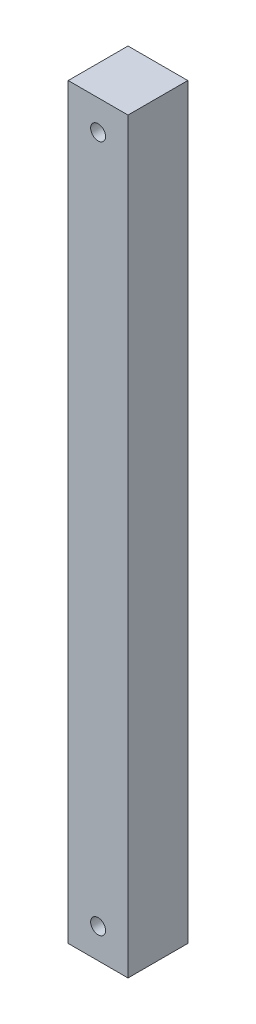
from build123d import *

# Parameters (mm, degrees)
SKETCH1_W           = 2
SKETCH1_H           = 25
SKETCH1_R           = 0.25
BOSS_EXTRUDE1_DEPTH = 2


with BuildPart() as part:
    # Sketch1 → Boss-Extrude1 (new body)
    with BuildSketch(Plane.XY):
        with Locations((9, 12.5)):
            Rectangle(SKETCH1_W, SKETCH1_H)
        with Locations((9, 24)):
            Circle(SKETCH1_R, mode=Mode.SUBTRACT)
        with Locations((9, 1)):
            Circle(SKETCH1_R, mode=Mode.SUBTRACT)
    extrude(amount=BOSS_EXTRUDE1_DEPTH)


solid = part.part
